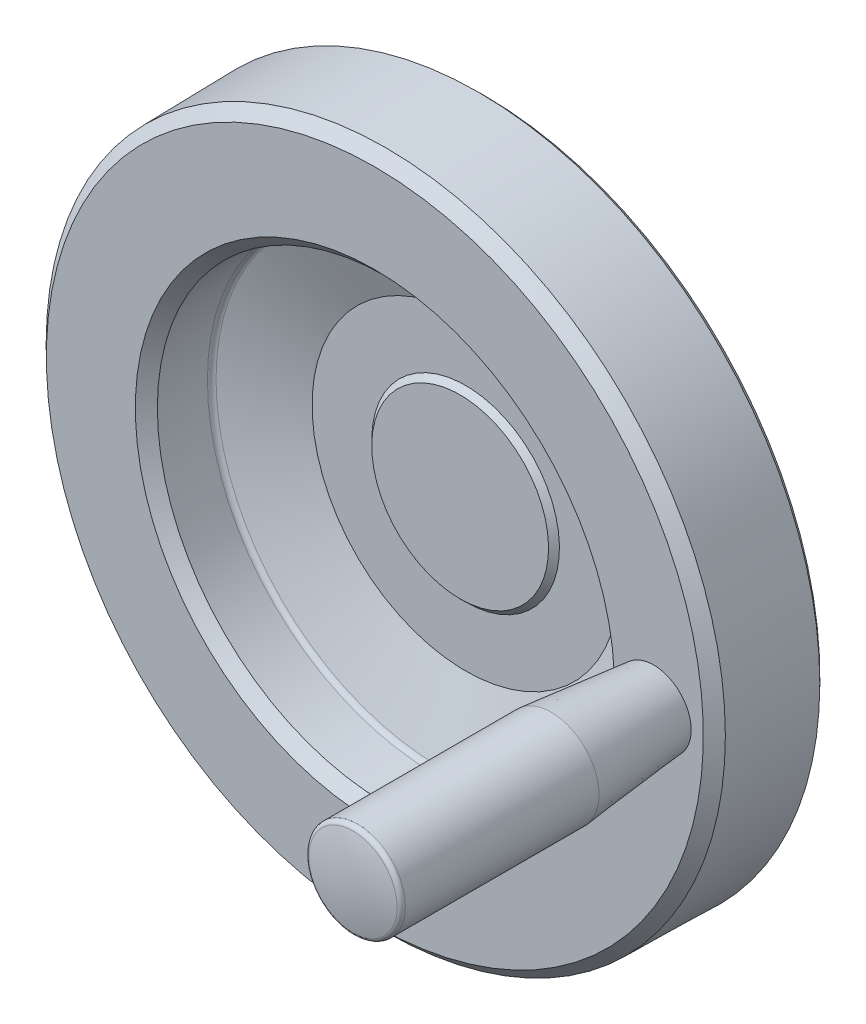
ISO-10303-21;
HEADER;
FILE_DESCRIPTION(('STEP AP214'),'2;1');
FILE_NAME('part.step','',(''),(''),'','','');
FILE_SCHEMA(('AUTOMOTIVE_DESIGN { 1 0 10303 214 1 1 1 1 }'));
ENDSEC;
DATA;
#1=APPLICATION_CONTEXT('core data for automotive mechanical design processes');
#2=APPLICATION_PROTOCOL_DEFINITION('international standard','automotive_design',2000,#1);
#3=PRODUCT_CONTEXT('',#1,'mechanical');
#4=PRODUCT('Part','Part','',(#3));
#5=PRODUCT_RELATED_PRODUCT_CATEGORY('part','',(#4));
#6=PRODUCT_DEFINITION_FORMATION('','',#4);
#7=PRODUCT_DEFINITION_CONTEXT('part definition',#1,'design');
#8=PRODUCT_DEFINITION('design','',#6,#7);
#9=PRODUCT_DEFINITION_SHAPE('','',#8);
#10=(LENGTH_UNIT() NAMED_UNIT(*) SI_UNIT(.MILLI.,.METRE.));
#11=(NAMED_UNIT(*) PLANE_ANGLE_UNIT() SI_UNIT($,.RADIAN.));
#12=(NAMED_UNIT(*) SI_UNIT($,.STERADIAN.) SOLID_ANGLE_UNIT());
#13=UNCERTAINTY_MEASURE_WITH_UNIT(LENGTH_MEASURE(1.E-05),#10,'distance_accuracy_value','');
#14=(GEOMETRIC_REPRESENTATION_CONTEXT(3) GLOBAL_UNCERTAINTY_ASSIGNED_CONTEXT((#13)) GLOBAL_UNIT_ASSIGNED_CONTEXT((#10,
#11,#12)) REPRESENTATION_CONTEXT('',''));
#15=CARTESIAN_POINT('',(0.,0.,0.));
#16=DIRECTION('',(0.,0.,1.));
#17=DIRECTION('',(1.,0.,0.));
#18=AXIS2_PLACEMENT_3D('',#15,#16,#17);
#19=CARTESIAN_POINT('',(82.,0.,51.919999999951));
#20=DIRECTION('',(0.,0.,1.));
#21=DIRECTION('',(-1.,0.,0.));
#22=AXIS2_PLACEMENT_3D('',#19,#20,#21);
#23=CONICAL_SURFACE('',#22,4.99999999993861,0.785398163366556);
#24=CARTESIAN_POINT('',(82.,0.,51.));
#25=DIRECTION('',(0.,0.,1.));
#26=DIRECTION('',(-1.,0.,0.));
#27=AXIS2_PLACEMENT_3D('',#24,#25,#26);
#28=CIRCLE('',#27,4.0800000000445);
#29=CARTESIAN_POINT('',(77.9199999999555,0.,51.));
#30=VERTEX_POINT('',#29);
#31=EDGE_CURVE('E132',#30,#30,#28,.T.);
#32=ORIENTED_EDGE('',*,*,#31,.T.);
#33=EDGE_LOOP('',(#32));
#34=FACE_BOUND('',#33,.T.);
#35=CARTESIAN_POINT('',(82.,0.,51.1079999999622));
#36=DIRECTION('',(0.,0.,1.));
#37=DIRECTION('',(0.,1.,0.));
#38=AXIS2_PLACEMENT_3D('',#35,#36,#37);
#39=CIRCLE('',#38,4.188);
#40=CARTESIAN_POINT('',(82.,4.188,51.1079999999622));
#41=VERTEX_POINT('',#40);
#42=EDGE_CURVE('E9',#41,#41,#39,.T.);
#43=ORIENTED_EDGE('',*,*,#42,.F.);
#44=EDGE_LOOP('',(#43));
#45=FACE_BOUND('',#44,.T.);
#46=ADVANCED_FACE('F15',(#34,#45),#23,.T.);
#47=CARTESIAN_POINT('',(82.,0.,51.));
#48=DIRECTION('',(0.,0.,1.));
#49=DIRECTION('',(-1.,0.,0.));
#50=AXIS2_PLACEMENT_3D('',#47,#48,#49);
#51=PLANE('',#50);
#52=DIRECTION('',(0.866025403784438,-0.5,0.));
#53=VECTOR('',#52,1.);
#54=CARTESIAN_POINT('',(82.,2.88675134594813,51.));
#55=LINE('',#54,#53);
#56=CARTESIAN_POINT('',(82.,2.88675134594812,51.));
#57=VERTEX_POINT('',#56);
#58=CARTESIAN_POINT('',(84.5,1.44337567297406,51.));
#59=VERTEX_POINT('',#58);
#60=EDGE_CURVE('E35',#57,#59,#55,.T.);
#61=ORIENTED_EDGE('',*,*,#60,.F.);
#62=DIRECTION('',(0.866025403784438,0.5,0.));
#63=VECTOR('',#62,1.);
#64=CARTESIAN_POINT('',(79.5,1.44337567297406,51.));
#65=LINE('',#64,#63);
#66=CARTESIAN_POINT('',(79.5,1.44337567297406,51.));
#67=VERTEX_POINT('',#66);
#68=EDGE_CURVE('E190',#67,#57,#65,.T.);
#69=ORIENTED_EDGE('',*,*,#68,.F.);
#70=DIRECTION('',(0.,-1.,0.));
#71=VECTOR('',#70,1.);
#72=CARTESIAN_POINT('',(79.5,0.,51.));
#73=LINE('',#72,#71);
#74=CARTESIAN_POINT('',(79.5,-1.44337567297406,51.));
#75=VERTEX_POINT('',#74);
#76=EDGE_CURVE('E188',#75,#67,#73,.F.);
#77=ORIENTED_EDGE('',*,*,#76,.F.);
#78=DIRECTION('',(-0.866025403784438,0.5,0.));
#79=VECTOR('',#78,1.);
#80=CARTESIAN_POINT('',(82.,-2.88675134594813,51.));
#81=LINE('',#80,#79);
#82=CARTESIAN_POINT('',(82.,-2.88675134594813,51.));
#83=VERTEX_POINT('',#82);
#84=EDGE_CURVE('E186',#83,#75,#81,.T.);
#85=ORIENTED_EDGE('',*,*,#84,.F.);
#86=DIRECTION('',(-0.866025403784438,-0.5,0.));
#87=VECTOR('',#86,1.);
#88=CARTESIAN_POINT('',(84.5,-1.44337567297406,51.));
#89=LINE('',#88,#87);
#90=CARTESIAN_POINT('',(84.5,-1.44337567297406,51.));
#91=VERTEX_POINT('',#90);
#92=EDGE_CURVE('E153',#91,#83,#89,.T.);
#93=ORIENTED_EDGE('',*,*,#92,.F.);
#94=DIRECTION('',(0.,-1.,0.));
#95=VECTOR('',#94,1.);
#96=CARTESIAN_POINT('',(84.5,0.,51.));
#97=LINE('',#96,#95);
#98=EDGE_CURVE('E136',#59,#91,#97,.T.);
#99=ORIENTED_EDGE('',*,*,#98,.F.);
#100=EDGE_LOOP('',(#61,#69,#77,#85,#93,#99));
#101=FACE_BOUND('',#100,.T.);
#102=ORIENTED_EDGE('',*,*,#31,.F.);
#103=EDGE_LOOP('',(#102));
#104=FACE_BOUND('',#103,.T.);
#105=ADVANCED_FACE('F229',(#101,#104),#51,.F.);
#106=CARTESIAN_POINT('',(84.5,1.44337567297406,55.25));
#107=DIRECTION('',(-0.5,-0.866025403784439,0.));
#108=DIRECTION('',(0.866025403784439,-0.5,0.));
#109=AXIS2_PLACEMENT_3D('',#106,#107,#108);
#110=PLANE('',#109);
#111=DIRECTION('',(-0.866025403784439,0.5,0.));
#112=VECTOR('',#111,1.);
#113=CARTESIAN_POINT('',(83.25,2.1650635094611,55.25));
#114=LINE('',#113,#112);
#115=CARTESIAN_POINT('',(83.2499999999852,2.1650635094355,55.2500000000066));
#116=VERTEX_POINT('',#115);
#117=CARTESIAN_POINT('',(82.,2.88675134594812,55.25));
#118=VERTEX_POINT('',#117);
#119=EDGE_CURVE('E97',#116,#118,#114,.T.);
#120=ORIENTED_EDGE('',*,*,#119,.T.);
#121=DIRECTION('',(0.,0.,1.));
#122=VECTOR('',#121,1.);
#123=CARTESIAN_POINT('',(82.,2.88675134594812,55.25));
#124=LINE('',#123,#122);
#125=EDGE_CURVE('E155',#118,#57,#124,.F.);
#126=ORIENTED_EDGE('',*,*,#125,.T.);
#127=ORIENTED_EDGE('',*,*,#60,.T.);
#128=DIRECTION('',(0.,0.,-1.));
#129=VECTOR('',#128,1.);
#130=CARTESIAN_POINT('',(84.5,1.44337567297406,55.25));
#131=LINE('',#130,#129);
#132=CARTESIAN_POINT('',(84.5,1.44337567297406,55.25));
#133=VERTEX_POINT('',#132);
#134=EDGE_CURVE('E99',#133,#59,#131,.T.);
#135=ORIENTED_EDGE('',*,*,#134,.F.);
#136=DIRECTION('',(-0.866025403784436,0.5,0.));
#137=VECTOR('',#136,1.);
#138=CARTESIAN_POINT('',(84.5,1.44337567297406,55.25));
#139=LINE('',#138,#137);
#140=EDGE_CURVE('E93',#133,#116,#139,.T.);
#141=ORIENTED_EDGE('',*,*,#140,.T.);
#142=EDGE_LOOP('',(#120,#126,#127,#135,#141));
#143=FACE_BOUND('',#142,.T.);
#144=ADVANCED_FACE('F95',(#143),#110,.T.);
#145=CARTESIAN_POINT('',(82.,2.88675134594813,55.25));
#146=DIRECTION('',(0.5,-0.866025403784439,0.));
#147=DIRECTION('',(0.866025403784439,0.5,0.));
#148=AXIS2_PLACEMENT_3D('',#145,#146,#147);
#149=PLANE('',#148);
#150=DIRECTION('',(-0.866025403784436,-0.5,0.));
#151=VECTOR('',#150,1.);
#152=CARTESIAN_POINT('',(80.75,2.1650635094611,55.25));
#153=LINE('',#152,#151);
#154=CARTESIAN_POINT('',(80.7500000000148,2.1650635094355,55.2500000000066));
#155=VERTEX_POINT('',#154);
#156=CARTESIAN_POINT('',(79.5,1.44337567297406,55.25));
#157=VERTEX_POINT('',#156);
#158=EDGE_CURVE('E167',#155,#157,#153,.T.);
#159=ORIENTED_EDGE('',*,*,#158,.T.);
#160=DIRECTION('',(0.,0.,1.));
#161=VECTOR('',#160,1.);
#162=CARTESIAN_POINT('',(79.5,1.44337567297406,55.25));
#163=LINE('',#162,#161);
#164=EDGE_CURVE('E157',#157,#67,#163,.F.);
#165=ORIENTED_EDGE('',*,*,#164,.T.);
#166=ORIENTED_EDGE('',*,*,#68,.T.);
#167=ORIENTED_EDGE('',*,*,#125,.F.);
#168=DIRECTION('',(-0.866025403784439,-0.5,0.));
#169=VECTOR('',#168,1.);
#170=CARTESIAN_POINT('',(82.,2.88675134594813,55.25));
#171=LINE('',#170,#169);
#172=EDGE_CURVE('E114',#118,#155,#171,.T.);
#173=ORIENTED_EDGE('',*,*,#172,.T.);
#174=EDGE_LOOP('',(#159,#165,#166,#167,#173));
#175=FACE_BOUND('',#174,.T.);
#176=ADVANCED_FACE('F240',(#175),#149,.T.);
#177=CARTESIAN_POINT('',(79.5,1.44337567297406,55.25));
#178=DIRECTION('',(1.,0.,0.));
#179=DIRECTION('',(0.,0.,1.));
#180=AXIS2_PLACEMENT_3D('',#177,#178,#179);
#181=PLANE('',#180);
#182=DIRECTION('',(0.,-1.,0.));
#183=VECTOR('',#182,1.);
#184=CARTESIAN_POINT('',(79.5,0.,55.25));
#185=LINE('',#184,#183);
#186=CARTESIAN_POINT('',(79.5000000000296,0.,55.2500000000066));
#187=VERTEX_POINT('',#186);
#188=CARTESIAN_POINT('',(79.5,-1.44337567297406,55.25));
#189=VERTEX_POINT('',#188);
#190=EDGE_CURVE('E171',#187,#189,#185,.T.);
#191=ORIENTED_EDGE('',*,*,#190,.T.);
#192=DIRECTION('',(0.,0.,1.));
#193=VECTOR('',#192,1.);
#194=CARTESIAN_POINT('',(79.5,-1.44337567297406,55.25));
#195=LINE('',#194,#193);
#196=EDGE_CURVE('E160',#189,#75,#195,.F.);
#197=ORIENTED_EDGE('',*,*,#196,.T.);
#198=ORIENTED_EDGE('',*,*,#76,.T.);
#199=ORIENTED_EDGE('',*,*,#164,.F.);
#200=DIRECTION('',(0.,-1.,0.));
#201=VECTOR('',#200,1.);
#202=CARTESIAN_POINT('',(79.5,0.,55.25));
#203=LINE('',#202,#201);
#204=EDGE_CURVE('E169',#157,#187,#203,.T.);
#205=ORIENTED_EDGE('',*,*,#204,.T.);
#206=EDGE_LOOP('',(#191,#197,#198,#199,#205));
#207=FACE_BOUND('',#206,.T.);
#208=ADVANCED_FACE('F243',(#207),#181,.T.);
#209=CARTESIAN_POINT('',(79.5,-1.44337567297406,55.25));
#210=DIRECTION('',(0.5,0.866025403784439,0.));
#211=DIRECTION('',(-0.866025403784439,0.5,0.));
#212=AXIS2_PLACEMENT_3D('',#209,#210,#211);
#213=PLANE('',#212);
#214=DIRECTION('',(-0.866025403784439,0.5,0.));
#215=VECTOR('',#214,1.);
#216=CARTESIAN_POINT('',(79.5,-1.44337567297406,55.25));
#217=LINE('',#216,#215);
#218=CARTESIAN_POINT('',(80.7500000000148,-2.1650635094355,55.2500000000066));
#219=VERTEX_POINT('',#218);
#220=CARTESIAN_POINT('',(82.,-2.88675134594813,55.25));
#221=VERTEX_POINT('',#220);
#222=EDGE_CURVE('E180',#219,#221,#217,.F.);
#223=ORIENTED_EDGE('',*,*,#222,.T.);
#224=DIRECTION('',(0.,0.,1.));
#225=VECTOR('',#224,1.);
#226=CARTESIAN_POINT('',(82.,-2.88675134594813,55.25));
#227=LINE('',#226,#225);
#228=EDGE_CURVE('E163',#221,#83,#227,.F.);
#229=ORIENTED_EDGE('',*,*,#228,.T.);
#230=ORIENTED_EDGE('',*,*,#84,.T.);
#231=ORIENTED_EDGE('',*,*,#196,.F.);
#232=DIRECTION('',(0.866025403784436,-0.5,0.));
#233=VECTOR('',#232,1.);
#234=CARTESIAN_POINT('',(79.5,-1.44337567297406,55.25));
#235=LINE('',#234,#233);
#236=EDGE_CURVE('E173',#189,#219,#235,.T.);
#237=ORIENTED_EDGE('',*,*,#236,.T.);
#238=EDGE_LOOP('',(#223,#229,#230,#231,#237));
#239=FACE_BOUND('',#238,.T.);
#240=ADVANCED_FACE('F247',(#239),#213,.T.);
#241=CARTESIAN_POINT('',(82.,-2.88675134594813,55.25));
#242=DIRECTION('',(-0.5,0.866025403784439,0.));
#243=DIRECTION('',(-0.866025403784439,-0.5,0.));
#244=AXIS2_PLACEMENT_3D('',#241,#242,#243);
#245=PLANE('',#244);
#246=DIRECTION('',(0.866025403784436,0.5,0.));
#247=VECTOR('',#246,1.);
#248=CARTESIAN_POINT('',(83.25,-2.1650635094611,55.25));
#249=LINE('',#248,#247);
#250=CARTESIAN_POINT('',(83.2499999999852,-2.1650635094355,55.2500000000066));
#251=VERTEX_POINT('',#250);
#252=CARTESIAN_POINT('',(84.5,-1.44337567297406,55.25));
#253=VERTEX_POINT('',#252);
#254=EDGE_CURVE('E175',#251,#253,#249,.T.);
#255=ORIENTED_EDGE('',*,*,#254,.T.);
#256=DIRECTION('',(0.,0.,-1.));
#257=VECTOR('',#256,1.);
#258=CARTESIAN_POINT('',(84.5,-1.44337567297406,55.25));
#259=LINE('',#258,#257);
#260=EDGE_CURVE('E154',#91,#253,#259,.F.);
#261=ORIENTED_EDGE('',*,*,#260,.F.);
#262=ORIENTED_EDGE('',*,*,#92,.T.);
#263=ORIENTED_EDGE('',*,*,#228,.F.);
#264=DIRECTION('',(-0.866025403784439,-0.5,0.));
#265=VECTOR('',#264,1.);
#266=CARTESIAN_POINT('',(82.,-2.88675134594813,55.25));
#267=LINE('',#266,#265);
#268=EDGE_CURVE('E131',#221,#251,#267,.F.);
#269=ORIENTED_EDGE('',*,*,#268,.T.);
#270=EDGE_LOOP('',(#255,#261,#262,#263,#269));
#271=FACE_BOUND('',#270,.T.);
#272=ADVANCED_FACE('F237',(#271),#245,.T.);
#273=CARTESIAN_POINT('',(84.5,-1.44337567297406,55.25));
#274=DIRECTION('',(-1.,0.,0.));
#275=DIRECTION('',(0.,0.,-1.));
#276=AXIS2_PLACEMENT_3D('',#273,#274,#275);
#277=PLANE('',#276);
#278=DIRECTION('',(0.,-1.,0.));
#279=VECTOR('',#278,1.);
#280=CARTESIAN_POINT('',(84.5,0.,55.25));
#281=LINE('',#280,#279);
#282=CARTESIAN_POINT('',(84.4999999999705,0.,55.2500000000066));
#283=VERTEX_POINT('',#282);
#284=EDGE_CURVE('E101',#283,#133,#281,.F.);
#285=ORIENTED_EDGE('',*,*,#284,.T.);
#286=ORIENTED_EDGE('',*,*,#134,.T.);
#287=ORIENTED_EDGE('',*,*,#98,.T.);
#288=ORIENTED_EDGE('',*,*,#260,.T.);
#289=DIRECTION('',(0.,-1.,0.));
#290=VECTOR('',#289,1.);
#291=CARTESIAN_POINT('',(84.5,0.,55.25));
#292=LINE('',#291,#290);
#293=EDGE_CURVE('E89',#253,#283,#292,.F.);
#294=ORIENTED_EDGE('',*,*,#293,.T.);
#295=EDGE_LOOP('',(#285,#286,#287,#288,#294));
#296=FACE_BOUND('',#295,.T.);
#297=ADVANCED_FACE('F234',(#296),#277,.T.);
#298=CARTESIAN_POINT('',(82.,0.,55.25));
#299=DIRECTION('',(0.,0.,1.));
#300=DIRECTION('',(-1.,0.,0.));
#301=AXIS2_PLACEMENT_3D('',#298,#299,#300);
#302=PLANE('',#301);
#303=ORIENTED_EDGE('',*,*,#172,.F.);
#304=ORIENTED_EDGE('',*,*,#119,.F.);
#305=CARTESIAN_POINT('',(82.,0.,55.2500000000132));
#306=DIRECTION('',(0.,0.,-1.));
#307=DIRECTION('',(1.,0.,0.));
#308=AXIS2_PLACEMENT_3D('',#305,#306,#307);
#309=CIRCLE('',#308,2.49999999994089);
#310=EDGE_CURVE('E108',#116,#155,#309,.F.);
#311=ORIENTED_EDGE('',*,*,#310,.T.);
#312=EDGE_LOOP('',(#303,#304,#311));
#313=FACE_BOUND('',#312,.T.);
#314=ADVANCED_FACE('F112',(#313),#302,.F.);
#315=CARTESIAN_POINT('',(82.,0.,55.25));
#316=DIRECTION('',(0.,0.,1.));
#317=DIRECTION('',(-1.,0.,0.));
#318=AXIS2_PLACEMENT_3D('',#315,#316,#317);
#319=PLANE('',#318);
#320=ORIENTED_EDGE('',*,*,#140,.F.);
#321=ORIENTED_EDGE('',*,*,#284,.F.);
#322=CARTESIAN_POINT('',(82.,0.,55.2500000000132));
#323=DIRECTION('',(0.,0.,-1.));
#324=DIRECTION('',(1.,0.,0.));
#325=AXIS2_PLACEMENT_3D('',#322,#323,#324);
#326=CIRCLE('',#325,2.49999999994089);
#327=EDGE_CURVE('E19',#283,#116,#326,.F.);
#328=ORIENTED_EDGE('',*,*,#327,.T.);
#329=EDGE_LOOP('',(#320,#321,#328));
#330=FACE_BOUND('',#329,.T.);
#331=ADVANCED_FACE('F17',(#330),#319,.F.);
#332=CARTESIAN_POINT('',(82.,0.,55.25));
#333=DIRECTION('',(0.,0.,1.));
#334=DIRECTION('',(-1.,0.,0.));
#335=AXIS2_PLACEMENT_3D('',#332,#333,#334);
#336=PLANE('',#335);
#337=ORIENTED_EDGE('',*,*,#204,.F.);
#338=ORIENTED_EDGE('',*,*,#158,.F.);
#339=CARTESIAN_POINT('',(82.,0.,55.2500000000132));
#340=DIRECTION('',(0.,0.,-1.));
#341=DIRECTION('',(1.,0.,0.));
#342=AXIS2_PLACEMENT_3D('',#339,#340,#341);
#343=CIRCLE('',#342,2.49999999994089);
#344=EDGE_CURVE('E121',#155,#187,#343,.F.);
#345=ORIENTED_EDGE('',*,*,#344,.T.);
#346=EDGE_LOOP('',(#337,#338,#345));
#347=FACE_BOUND('',#346,.T.);
#348=ADVANCED_FACE('F269',(#347),#336,.F.);
#349=CARTESIAN_POINT('',(82.,0.,55.25));
#350=DIRECTION('',(0.,0.,1.));
#351=DIRECTION('',(-1.,0.,0.));
#352=AXIS2_PLACEMENT_3D('',#349,#350,#351);
#353=PLANE('',#352);
#354=ORIENTED_EDGE('',*,*,#236,.F.);
#355=ORIENTED_EDGE('',*,*,#190,.F.);
#356=CARTESIAN_POINT('',(82.,0.,55.2500000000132));
#357=DIRECTION('',(0.,0.,-1.));
#358=DIRECTION('',(1.,0.,0.));
#359=AXIS2_PLACEMENT_3D('',#356,#357,#358);
#360=CIRCLE('',#359,2.49999999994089);
#361=EDGE_CURVE('E122',#187,#219,#360,.F.);
#362=ORIENTED_EDGE('',*,*,#361,.T.);
#363=EDGE_LOOP('',(#354,#355,#362));
#364=FACE_BOUND('',#363,.T.);
#365=ADVANCED_FACE('F259',(#364),#353,.F.);
#366=CARTESIAN_POINT('',(82.,0.,55.25));
#367=DIRECTION('',(0.,0.,1.));
#368=DIRECTION('',(-1.,0.,0.));
#369=AXIS2_PLACEMENT_3D('',#366,#367,#368);
#370=PLANE('',#369);
#371=ORIENTED_EDGE('',*,*,#268,.F.);
#372=ORIENTED_EDGE('',*,*,#222,.F.);
#373=CARTESIAN_POINT('',(82.,0.,55.2500000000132));
#374=DIRECTION('',(0.,0.,-1.));
#375=DIRECTION('',(1.,0.,0.));
#376=AXIS2_PLACEMENT_3D('',#373,#374,#375);
#377=CIRCLE('',#376,2.49999999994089);
#378=EDGE_CURVE('E129',#251,#219,#377,.T.);
#379=ORIENTED_EDGE('',*,*,#378,.F.);
#380=EDGE_LOOP('',(#371,#372,#379));
#381=FACE_BOUND('',#380,.T.);
#382=ADVANCED_FACE('F255',(#381),#370,.F.);
#383=CARTESIAN_POINT('',(82.,0.,55.25));
#384=DIRECTION('',(0.,0.,1.));
#385=DIRECTION('',(-1.,0.,0.));
#386=AXIS2_PLACEMENT_3D('',#383,#384,#385);
#387=PLANE('',#386);
#388=ORIENTED_EDGE('',*,*,#293,.F.);
#389=ORIENTED_EDGE('',*,*,#254,.F.);
#390=CARTESIAN_POINT('',(82.,0.,55.2500000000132));
#391=DIRECTION('',(0.,0.,-1.));
#392=DIRECTION('',(1.,0.,0.));
#393=AXIS2_PLACEMENT_3D('',#390,#391,#392);
#394=CIRCLE('',#393,2.49999999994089);
#395=EDGE_CURVE('E127',#251,#283,#394,.F.);
#396=ORIENTED_EDGE('',*,*,#395,.T.);
#397=EDGE_LOOP('',(#388,#389,#396));
#398=FACE_BOUND('',#397,.T.);
#399=ADVANCED_FACE('F258',(#398),#387,.F.);
#400=CARTESIAN_POINT('',(82.,0.,55.2500000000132));
#401=DIRECTION('',(0.,0.,-1.));
#402=DIRECTION('',(1.,0.,0.));
#403=AXIS2_PLACEMENT_3D('',#400,#401,#402);
#404=CONICAL_SURFACE('',#403,2.49999999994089,1.04719755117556);
#405=CARTESIAN_POINT('',(81.9999999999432,0.,56.6933756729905));
#406=VERTEX_POINT('',#405);
#407=VERTEX_LOOP('',#406);
#408=FACE_BOUND('',#407,.T.);
#409=ORIENTED_EDGE('',*,*,#378,.T.);
#410=ORIENTED_EDGE('',*,*,#361,.F.);
#411=ORIENTED_EDGE('',*,*,#344,.F.);
#412=ORIENTED_EDGE('',*,*,#310,.F.);
#413=ORIENTED_EDGE('',*,*,#327,.F.);
#414=ORIENTED_EDGE('',*,*,#395,.F.);
#415=EDGE_LOOP('',(#409,#410,#411,#412,#413,#414));
#416=FACE_BOUND('',#415,.T.);
#417=ADVANCED_FACE('F118',(#408,#416),#404,.F.);
#418=CARTESIAN_POINT('',(82.,0.,158.));
#419=DIRECTION('',(0.,0.,-1.));
#420=DIRECTION('',(1.,0.,0.));
#421=AXIS2_PLACEMENT_3D('',#418,#419,#420);
#422=CYLINDRICAL_SURFACE('',#421,6.5);
#423=CARTESIAN_POINT('',(82.,0.,68.));
#424=DIRECTION('',(0.,0.,-1.));
#425=DIRECTION('',(0.,-1.,0.));
#426=AXIS2_PLACEMENT_3D('',#423,#424,#425);
#427=CIRCLE('',#426,6.5);
#428=CARTESIAN_POINT('',(82.,-6.5,68.));
#429=VERTEX_POINT('',#428);
#430=EDGE_CURVE('E329',#429,#429,#427,.T.);
#431=ORIENTED_EDGE('',*,*,#430,.F.);
#432=EDGE_LOOP('',(#431));
#433=FACE_BOUND('',#432,.T.);
#434=CARTESIAN_POINT('',(82.,0.,68.3));
#435=DIRECTION('',(0.,0.,-1.));
#436=DIRECTION('',(1.,0.,0.));
#437=AXIS2_PLACEMENT_3D('',#434,#435,#436);
#438=CIRCLE('',#437,6.5);
#439=CARTESIAN_POINT('',(88.5,0.,68.3));
#440=VERTEX_POINT('',#439);
#441=EDGE_CURVE('E142',#440,#440,#438,.T.);
#442=ORIENTED_EDGE('',*,*,#441,.T.);
#443=EDGE_LOOP('',(#442));
#444=FACE_BOUND('',#443,.T.);
#445=ADVANCED_FACE('F207',(#433,#444),#422,.T.);
#446=CARTESIAN_POINT('',(82.,-6.5,68.3));
#447=DIRECTION('',(0.,0.,1.));
#448=DIRECTION('',(-1.,0.,0.));
#449=AXIS2_PLACEMENT_3D('',#446,#447,#448);
#450=PLANE('',#449);
#451=ORIENTED_EDGE('',*,*,#441,.F.);
#452=EDGE_LOOP('',(#451));
#453=FACE_BOUND('',#452,.T.);
#454=CARTESIAN_POINT('',(82.,0.,68.3));
#455=DIRECTION('',(0.,0.,1.));
#456=DIRECTION('',(0.,-1.,0.));
#457=AXIS2_PLACEMENT_3D('',#454,#455,#456);
#458=CIRCLE('',#457,11.);
#459=CARTESIAN_POINT('',(82.,-11.,68.3));
#460=VERTEX_POINT('',#459);
#461=EDGE_CURVE('E148',#460,#460,#458,.T.);
#462=ORIENTED_EDGE('',*,*,#461,.F.);
#463=EDGE_LOOP('',(#462));
#464=FACE_BOUND('',#463,.T.);
#465=ADVANCED_FACE('F208',(#453,#464),#450,.F.);
#466=CARTESIAN_POINT('',(82.,0.,98.3));
#467=DIRECTION('',(0.,0.,1.));
#468=DIRECTION('',(0.,-1.,0.));
#469=AXIS2_PLACEMENT_3D('',#466,#467,#468);
#470=CONICAL_SURFACE('',#469,14.,0.099668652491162);
#471=ORIENTED_EDGE('',*,*,#461,.T.);
#472=EDGE_LOOP('',(#471));
#473=FACE_BOUND('',#472,.T.);
#474=CARTESIAN_POINT('',(82.,0.,98.3));
#475=DIRECTION('',(0.,0.,-1.));
#476=DIRECTION('',(1.,0.,0.));
#477=AXIS2_PLACEMENT_3D('',#474,#475,#476);
#478=CIRCLE('',#477,14.);
#479=CARTESIAN_POINT('',(96.,0.,98.3));
#480=VERTEX_POINT('',#479);
#481=EDGE_CURVE('E315',#480,#480,#478,.F.);
#482=ORIENTED_EDGE('',*,*,#481,.F.);
#483=EDGE_LOOP('',(#482));
#484=FACE_BOUND('',#483,.T.);
#485=ADVANCED_FACE('F296',(#473,#484),#470,.T.);
#486=CARTESIAN_POINT('',(82.,0.,158.));
#487=DIRECTION('',(0.,0.,-1.));
#488=DIRECTION('',(1.,0.,0.));
#489=AXIS2_PLACEMENT_3D('',#486,#487,#488);
#490=CYLINDRICAL_SURFACE('',#489,14.);
#491=ORIENTED_EDGE('',*,*,#481,.T.);
#492=EDGE_LOOP('',(#491));
#493=FACE_BOUND('',#492,.T.);
#494=CARTESIAN_POINT('',(82.,0.,155.051394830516));
#495=DIRECTION('',(0.,0.,-1.));
#496=DIRECTION('',(1.,0.,0.));
#497=AXIS2_PLACEMENT_3D('',#494,#495,#496);
#498=CIRCLE('',#497,14.);
#499=CARTESIAN_POINT('',(96.,0.,155.051394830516));
#500=VERTEX_POINT('',#499);
#501=EDGE_CURVE('E151',#500,#500,#498,.T.);
#502=ORIENTED_EDGE('',*,*,#501,.T.);
#503=EDGE_LOOP('',(#502));
#504=FACE_BOUND('',#503,.T.);
#505=ADVANCED_FACE('F293',(#493,#504),#490,.T.);
#506=CARTESIAN_POINT('',(82.,0.,155.051394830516));
#507=DIRECTION('',(0.,0.,1.));
#508=DIRECTION('',(-1.,0.,0.));
#509=AXIS2_PLACEMENT_3D('',#506,#507,#508);
#510=TOROIDAL_SURFACE('',#509,12.6,1.4);
#511=CARTESIAN_POINT('',(82.,0.,156.409728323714));
#512=DIRECTION('',(0.,0.,1.));
#513=DIRECTION('',(-1.,0.,0.));
#514=AXIS2_PLACEMENT_3D('',#511,#512,#513);
#515=CIRCLE('',#514,12.9390134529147);
#516=CARTESIAN_POINT('',(69.0609865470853,0.,156.409728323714));
#517=VERTEX_POINT('',#516);
#518=EDGE_CURVE('E145',#517,#517,#515,.F.);
#519=ORIENTED_EDGE('',*,*,#518,.T.);
#520=EDGE_LOOP('',(#519));
#521=FACE_BOUND('',#520,.T.);
#522=ORIENTED_EDGE('',*,*,#501,.F.);
#523=EDGE_LOOP('',(#522));
#524=FACE_BOUND('',#523,.T.);
#525=ADVANCED_FACE('F205',(#521,#524),#510,.T.);
#526=CARTESIAN_POINT('',(82.,-3.31679359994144E-13,104.566666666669));
#527=DIRECTION('',(0.,1.,0.));
#528=DIRECTION('',(-1.,0.,0.));
#529=AXIS2_PLACEMENT_3D('',#526,#527,#528);
#530=SPHERICAL_SURFACE('',#529,53.4333333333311);
#531=ORIENTED_EDGE('',*,*,#518,.F.);
#532=EDGE_LOOP('',(#531));
#533=FACE_BOUND('',#532,.T.);
#534=ADVANCED_FACE('F200',(#533),#530,.T.);
#535=CARTESIAN_POINT('',(82.,0.,36.));
#536=DIRECTION('',(0.,0.,1.));
#537=DIRECTION('',(0.,1.,0.));
#538=AXIS2_PLACEMENT_3D('',#535,#536,#537);
#539=CYLINDRICAL_SURFACE('',#538,4.188);
#540=ORIENTED_EDGE('',*,*,#42,.T.);
#541=EDGE_LOOP('',(#540));
#542=FACE_BOUND('',#541,.T.);
#543=CARTESIAN_POINT('',(82.,0.,36.8119999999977));
#544=DIRECTION('',(0.,0.,-1.));
#545=DIRECTION('',(0.,-1.,0.));
#546=AXIS2_PLACEMENT_3D('',#543,#544,#545);
#547=CIRCLE('',#546,4.18799999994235);
#548=CARTESIAN_POINT('',(82.,-4.18799999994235,36.8119999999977));
#549=VERTEX_POINT('',#548);
#550=EDGE_CURVE('E803',#549,#549,#547,.T.);
#551=ORIENTED_EDGE('',*,*,#550,.T.);
#552=EDGE_LOOP('',(#551));
#553=FACE_BOUND('',#552,.T.);
#554=ADVANCED_FACE('F204',(#542,#553),#539,.F.);
#555=CARTESIAN_POINT('',(82.,0.,36.000000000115));
#556=DIRECTION('',(0.,0.,-1.));
#557=DIRECTION('',(0.,-1.,0.));
#558=AXIS2_PLACEMENT_3D('',#555,#556,#557);
#559=CONICAL_SURFACE('',#558,4.99999999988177,0.785398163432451);
#560=ORIENTED_EDGE('',*,*,#550,.F.);
#561=EDGE_LOOP('',(#560));
#562=FACE_BOUND('',#561,.T.);
#563=CARTESIAN_POINT('',(82.,0.,36.0000000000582));
#564=DIRECTION('',(0.,0.,-1.));
#565=DIRECTION('',(0.,-1.,0.));
#566=AXIS2_PLACEMENT_3D('',#563,#564,#565);
#567=CIRCLE('',#566,4.99999999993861);
#568=CARTESIAN_POINT('',(82.,-4.99999999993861,36.0000000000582));
#569=VERTEX_POINT('',#568);
#570=EDGE_CURVE('E353',#569,#569,#567,.T.);
#571=ORIENTED_EDGE('',*,*,#570,.T.);
#572=EDGE_LOOP('',(#571));
#573=FACE_BOUND('',#572,.T.);
#574=ADVANCED_FACE('F482',(#562,#573),#559,.F.);
#575=CARTESIAN_POINT('',(-98.4279281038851,0.,36.));
#576=DIRECTION('',(0.,0.,1.));
#577=DIRECTION('',(0.,1.,0.));
#578=AXIS2_PLACEMENT_3D('',#575,#576,#577);
#579=PLANE('',#578);
#580=CARTESIAN_POINT('',(0.,0.,36.));
#581=DIRECTION('',(0.,0.,1.));
#582=DIRECTION('',(0.,1.,0.));
#583=AXIS2_PLACEMENT_3D('',#580,#581,#582);
#584=CIRCLE('',#583,98.4279281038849);
#585=CARTESIAN_POINT('',(0.,98.4279281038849,36.));
#586=VERTEX_POINT('',#585);
#587=EDGE_CURVE('E363',#586,#586,#584,.T.);
#588=ORIENTED_EDGE('',*,*,#587,.F.);
#589=EDGE_LOOP('',(#588));
#590=FACE_BOUND('',#589,.T.);
#591=ORIENTED_EDGE('',*,*,#570,.F.);
#592=EDGE_LOOP('',(#591));
#593=FACE_BOUND('',#592,.T.);
#594=CARTESIAN_POINT('',(0.,0.,36.));
#595=DIRECTION('',(0.,0.,1.));
#596=DIRECTION('',(0.,1.,0.));
#597=AXIS2_PLACEMENT_3D('',#594,#595,#596);
#598=CIRCLE('',#597,66.6666666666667);
#599=CARTESIAN_POINT('',(0.,66.6666666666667,36.));
#600=VERTEX_POINT('',#599);
#601=EDGE_CURVE('E350',#600,#600,#598,.F.);
#602=ORIENTED_EDGE('',*,*,#601,.F.);
#603=EDGE_LOOP('',(#602));
#604=FACE_BOUND('',#603,.T.);
#605=ADVANCED_FACE('F485',(#590,#593,#604),#579,.F.);
#606=CARTESIAN_POINT('',(-70.1933203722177,0.,68.));
#607=DIRECTION('',(0.,0.,-1.));
#608=DIRECTION('',(0.,-1.,0.));
#609=AXIS2_PLACEMENT_3D('',#606,#607,#608);
#610=PLANE('',#609);
#611=ORIENTED_EDGE('',*,*,#430,.T.);
#612=EDGE_LOOP('',(#611));
#613=FACE_BOUND('',#612,.T.);
#614=CARTESIAN_POINT('',(0.,0.,68.));
#615=DIRECTION('',(0.,0.,1.));
#616=DIRECTION('',(0.,1.,0.));
#617=AXIS2_PLACEMENT_3D('',#614,#615,#616);
#618=CIRCLE('',#617,70.1933203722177);
#619=CARTESIAN_POINT('',(0.,70.1933203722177,68.));
#620=VERTEX_POINT('',#619);
#621=EDGE_CURVE('E360',#620,#620,#618,.T.);
#622=ORIENTED_EDGE('',*,*,#621,.F.);
#623=EDGE_LOOP('',(#622));
#624=FACE_BOUND('',#623,.T.);
#625=CARTESIAN_POINT('',(0.,0.,68.));
#626=DIRECTION('',(0.,0.,-1.));
#627=DIRECTION('',(0.,-1.,0.));
#628=AXIS2_PLACEMENT_3D('',#625,#626,#627);
#629=CIRCLE('',#628,96.2693660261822);
#630=CARTESIAN_POINT('',(0.,-96.2693660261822,68.));
#631=VERTEX_POINT('',#630);
#632=EDGE_CURVE('E366',#631,#631,#629,.T.);
#633=ORIENTED_EDGE('',*,*,#632,.F.);
#634=EDGE_LOOP('',(#633));
#635=FACE_BOUND('',#634,.T.);
#636=ADVANCED_FACE('F634',(#613,#624,#635),#610,.F.);
#637=CARTESIAN_POINT('',(0.,0.,68.));
#638=DIRECTION('',(0.,0.,1.));
#639=DIRECTION('',(0.,1.,0.));
#640=AXIS2_PLACEMENT_3D('',#637,#638,#639);
#641=CONICAL_SURFACE('',#640,70.1933203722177,0.79412480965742);
#642=CARTESIAN_POINT('',(0.,0.,64.8004873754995));
#643=DIRECTION('',(0.,0.,1.));
#644=DIRECTION('',(0.,1.,0.));
#645=AXIS2_PLACEMENT_3D('',#642,#643,#644);
#646=CIRCLE('',#645,66.9374726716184);
#647=CARTESIAN_POINT('',(0.,66.9374726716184,64.8004873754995));
#648=VERTEX_POINT('',#647);
#649=EDGE_CURVE('E354',#648,#648,#646,.T.);
#650=ORIENTED_EDGE('',*,*,#649,.F.);
#651=EDGE_LOOP('',(#650));
#652=FACE_BOUND('',#651,.T.);
#653=ORIENTED_EDGE('',*,*,#621,.T.);
#654=EDGE_LOOP('',(#653));
#655=FACE_BOUND('',#654,.T.);
#656=ADVANCED_FACE('F480',(#652,#655),#641,.F.);
#657=CARTESIAN_POINT('',(0.,0.,64.8004873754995));
#658=DIRECTION('',(0.,0.,-1.));
#659=DIRECTION('',(0.,-1.,0.));
#660=AXIS2_PLACEMENT_3D('',#657,#658,#659);
#661=CONICAL_SURFACE('',#660,99.5252137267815,0.794124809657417);
#662=ORIENTED_EDGE('',*,*,#632,.T.);
#663=EDGE_LOOP('',(#662));
#664=FACE_BOUND('',#663,.T.);
#665=CARTESIAN_POINT('',(0.,0.,64.8004873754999));
#666=DIRECTION('',(0.,0.,-1.));
#667=DIRECTION('',(0.,-1.,0.));
#668=AXIS2_PLACEMENT_3D('',#665,#666,#667);
#669=CIRCLE('',#668,99.5252137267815);
#670=CARTESIAN_POINT('',(0.,-99.5252137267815,64.8004873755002));
#671=VERTEX_POINT('',#670);
#672=EDGE_CURVE('E331',#671,#671,#669,.T.);
#673=ORIENTED_EDGE('',*,*,#672,.F.);
#674=EDGE_LOOP('',(#673));
#675=FACE_BOUND('',#674,.T.);
#676=ADVANCED_FACE('F495',(#664,#675),#661,.T.);
#677=CARTESIAN_POINT('',(0.,0.,64.8004873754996));
#678=DIRECTION('',(0.,0.,1.));
#679=DIRECTION('',(0.,1.,0.));
#680=AXIS2_PLACEMENT_3D('',#677,#678,#679);
#681=CONICAL_SURFACE('',#680,66.9374726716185,0.0174532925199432);
#682=CARTESIAN_POINT('',(0.,0.,50.3855037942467));
#683=DIRECTION('',(0.,0.,1.));
#684=DIRECTION('',(0.,1.,0.));
#685=AXIS2_PLACEMENT_3D('',#682,#683,#684);
#686=CIRCLE('',#685,66.6858581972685);
#687=CARTESIAN_POINT('',(0.,66.6858581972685,50.3855037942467));
#688=VERTEX_POINT('',#687);
#689=EDGE_CURVE('E514',#688,#688,#686,.T.);
#690=ORIENTED_EDGE('',*,*,#689,.F.);
#691=EDGE_LOOP('',(#690));
#692=FACE_BOUND('',#691,.T.);
#693=ORIENTED_EDGE('',*,*,#649,.T.);
#694=EDGE_LOOP('',(#693));
#695=FACE_BOUND('',#694,.T.);
#696=ADVANCED_FACE('F492',(#692,#695),#681,.F.);
#697=CARTESIAN_POINT('',(0.,0.,37.5997563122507));
#698=DIRECTION('',(0.,0.,-1.));
#699=DIRECTION('',(0.,-1.,0.));
#700=AXIS2_PLACEMENT_3D('',#697,#698,#699);
#701=CONICAL_SURFACE('',#700,100.000004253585,0.0174532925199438);
#702=ORIENTED_EDGE('',*,*,#672,.T.);
#703=EDGE_LOOP('',(#702));
#704=FACE_BOUND('',#703,.T.);
#705=CARTESIAN_POINT('',(0.,0.,37.5997563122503));
#706=DIRECTION('',(0.,0.,-1.));
#707=DIRECTION('',(0.,-1.,0.));
#708=AXIS2_PLACEMENT_3D('',#705,#706,#707);
#709=CIRCLE('',#708,100.000004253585);
#710=CARTESIAN_POINT('',(0.,-100.000004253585,37.5997563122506));
#711=VERTEX_POINT('',#710);
#712=EDGE_CURVE('E369',#711,#711,#709,.F.);
#713=ORIENTED_EDGE('',*,*,#712,.T.);
#714=EDGE_LOOP('',(#713));
#715=FACE_BOUND('',#714,.T.);
#716=ADVANCED_FACE('F494',(#704,#715),#701,.T.);
#717=CARTESIAN_POINT('',(0.,0.,50.4134276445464));
#718=DIRECTION('',(0.,0.,-1.));
#719=DIRECTION('',(0.,-1.,0.));
#720=AXIS2_PLACEMENT_3D('',#717,#718,#719);
#721=TOROIDAL_SURFACE('',#720,65.0861018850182,1.6);
#722=CARTESIAN_POINT('',(0.,0.,48.9099194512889));
#723=DIRECTION('',(0.,0.,-1.));
#724=DIRECTION('',(0.,-1.,0.));
#725=AXIS2_PLACEMENT_3D('',#722,#723,#724);
#726=CIRCLE('',#725,65.6333341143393);
#727=CARTESIAN_POINT('',(0.,-65.6333341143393,48.9099194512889));
#728=VERTEX_POINT('',#727);
#729=EDGE_CURVE('E515',#728,#728,#726,.F.);
#730=ORIENTED_EDGE('',*,*,#729,.F.);
#731=EDGE_LOOP('',(#730));
#732=FACE_BOUND('',#731,.T.);
#733=ORIENTED_EDGE('',*,*,#689,.T.);
#734=EDGE_LOOP('',(#733));
#735=FACE_BOUND('',#734,.T.);
#736=ADVANCED_FACE('F504',(#732,#735),#721,.F.);
#737=CARTESIAN_POINT('',(0.,0.,37.5997563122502));
#738=DIRECTION('',(0.,0.,1.));
#739=DIRECTION('',(0.,1.,0.));
#740=AXIS2_PLACEMENT_3D('',#737,#738,#739);
#741=CONICAL_SURFACE('',#740,100.000004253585,0.776671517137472);
#742=ORIENTED_EDGE('',*,*,#712,.F.);
#743=EDGE_LOOP('',(#742));
#744=FACE_BOUND('',#743,.T.);
#745=ORIENTED_EDGE('',*,*,#587,.T.);
#746=EDGE_LOOP('',(#745));
#747=FACE_BOUND('',#746,.T.);
#748=ADVANCED_FACE('F490',(#744,#747),#741,.T.);
#749=CARTESIAN_POINT('',(0.,0.,0.));
#750=DIRECTION('',(0.,0.,1.));
#751=DIRECTION('',(0.,1.,0.));
#752=AXIS2_PLACEMENT_3D('',#749,#750,#751);
#753=CYLINDRICAL_SURFACE('',#752,66.6666666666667);
#754=ORIENTED_EDGE('',*,*,#601,.T.);
#755=EDGE_LOOP('',(#754));
#756=FACE_BOUND('',#755,.T.);
#757=CARTESIAN_POINT('',(0.,0.,39.7149631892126));
#758=DIRECTION('',(0.,0.,1.));
#759=DIRECTION('',(0.,1.,0.));
#760=AXIS2_PLACEMENT_3D('',#757,#758,#759);
#761=CIRCLE('',#760,66.6666666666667);
#762=CARTESIAN_POINT('',(0.,66.6666666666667,39.7149631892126));
#763=VERTEX_POINT('',#762);
#764=EDGE_CURVE('E802',#763,#763,#761,.F.);
#765=ORIENTED_EDGE('',*,*,#764,.F.);
#766=EDGE_LOOP('',(#765));
#767=FACE_BOUND('',#766,.T.);
#768=ADVANCED_FACE('F487',(#756,#767),#753,.F.);
#769=CARTESIAN_POINT('',(0.,0.,48.9099194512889));
#770=DIRECTION('',(0.,0.,1.));
#771=DIRECTION('',(1.,0.,0.));
#772=AXIS2_PLACEMENT_3D('',#769,#770,#771);
#773=CONICAL_SURFACE('',#772,65.6333341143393,1.22173047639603);
#774=CARTESIAN_POINT('',(0.,0.,41.4));
#775=DIRECTION('',(0.,0.,1.));
#776=DIRECTION('',(1.,0.,0.));
#777=AXIS2_PLACEMENT_3D('',#774,#775,#776);
#778=CIRCLE('',#777,45.);
#779=CARTESIAN_POINT('',(45.,0.,41.4));
#780=VERTEX_POINT('',#779);
#781=EDGE_CURVE('E346',#780,#780,#778,.T.);
#782=ORIENTED_EDGE('',*,*,#781,.F.);
#783=EDGE_LOOP('',(#782));
#784=FACE_BOUND('',#783,.T.);
#785=ORIENTED_EDGE('',*,*,#729,.T.);
#786=EDGE_LOOP('',(#785));
#787=FACE_BOUND('',#786,.T.);
#788=ADVANCED_FACE('F390',(#784,#787),#773,.F.);
#789=CARTESIAN_POINT('',(0.,0.,39.7149631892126));
#790=DIRECTION('',(0.,0.,-1.));
#791=DIRECTION('',(0.,-1.,0.));
#792=AXIS2_PLACEMENT_3D('',#789,#790,#791);
#793=TOROIDAL_SURFACE('',#792,65.0666666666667,1.6);
#794=ORIENTED_EDGE('',*,*,#764,.T.);
#795=EDGE_LOOP('',(#794));
#796=FACE_BOUND('',#795,.T.);
#797=CARTESIAN_POINT('',(0.,0.,41.21847138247));
#798=DIRECTION('',(0.,0.,-1.));
#799=DIRECTION('',(0.,-1.,0.));
#800=AXIS2_PLACEMENT_3D('',#797,#798,#799);
#801=CIRCLE('',#800,64.5194344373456);
#802=CARTESIAN_POINT('',(0.,-64.5194344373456,41.21847138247));
#803=VERTEX_POINT('',#802);
#804=EDGE_CURVE('E511',#803,#803,#801,.T.);
#805=ORIENTED_EDGE('',*,*,#804,.F.);
#806=EDGE_LOOP('',(#805));
#807=FACE_BOUND('',#806,.T.);
#808=ADVANCED_FACE('F396',(#796,#807),#793,.F.);
#809=CARTESIAN_POINT('',(-27.5,0.,41.4));
#810=DIRECTION('',(0.,0.,-1.));
#811=DIRECTION('',(0.,-1.,0.));
#812=AXIS2_PLACEMENT_3D('',#809,#810,#811);
#813=PLANE('',#812);
#814=CARTESIAN_POINT('',(0.,0.,41.4));
#815=DIRECTION('',(0.,0.,-1.));
#816=DIRECTION('',(0.,-1.,0.));
#817=AXIS2_PLACEMENT_3D('',#814,#815,#816);
#818=CIRCLE('',#817,27.5);
#819=CARTESIAN_POINT('',(0.,-27.5,41.4));
#820=VERTEX_POINT('',#819);
#821=EDGE_CURVE('E342',#820,#820,#818,.F.);
#822=ORIENTED_EDGE('',*,*,#821,.F.);
#823=EDGE_LOOP('',(#822));
#824=FACE_BOUND('',#823,.T.);
#825=ORIENTED_EDGE('',*,*,#781,.T.);
#826=EDGE_LOOP('',(#825));
#827=FACE_BOUND('',#826,.T.);
#828=ADVANCED_FACE('F392',(#824,#827),#813,.F.);
#829=CARTESIAN_POINT('',(0.,0.,41.2184713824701));
#830=DIRECTION('',(0.,0.,1.));
#831=DIRECTION('',(0.,1.,0.));
#832=AXIS2_PLACEMENT_3D('',#829,#830,#831);
#833=CONICAL_SURFACE('',#832,64.5194344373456,1.22173047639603);
#834=ORIENTED_EDGE('',*,*,#804,.T.);
#835=EDGE_LOOP('',(#834));
#836=FACE_BOUND('',#835,.T.);
#837=CARTESIAN_POINT('',(0.,0.,29.0376008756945));
#838=DIRECTION('',(0.,0.,1.));
#839=DIRECTION('',(0.,1.,0.));
#840=AXIS2_PLACEMENT_3D('',#837,#838,#839);
#841=CIRCLE('',#840,31.0527677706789);
#842=CARTESIAN_POINT('',(0.,31.0527677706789,29.0376008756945));
#843=VERTEX_POINT('',#842);
#844=EDGE_CURVE('E349',#843,#843,#841,.T.);
#845=ORIENTED_EDGE('',*,*,#844,.T.);
#846=EDGE_LOOP('',(#845));
#847=FACE_BOUND('',#846,.T.);
#848=ADVANCED_FACE('F395',(#836,#847),#833,.T.);
#849=CARTESIAN_POINT('',(0.,0.,41.4));
#850=DIRECTION('',(0.,0.,-1.));
#851=DIRECTION('',(0.,-1.,0.));
#852=AXIS2_PLACEMENT_3D('',#849,#850,#851);
#853=CONICAL_SURFACE('',#852,27.5,0.785398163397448);
#854=CARTESIAN_POINT('',(0.,0.,43.));
#855=DIRECTION('',(0.,0.,-1.));
#856=DIRECTION('',(0.,-1.,0.));
#857=AXIS2_PLACEMENT_3D('',#854,#855,#856);
#858=CIRCLE('',#857,25.9);
#859=CARTESIAN_POINT('',(0.,-25.9,43.));
#860=VERTEX_POINT('',#859);
#861=EDGE_CURVE('E336',#860,#860,#858,.T.);
#862=ORIENTED_EDGE('',*,*,#861,.T.);
#863=EDGE_LOOP('',(#862));
#864=FACE_BOUND('',#863,.T.);
#865=ORIENTED_EDGE('',*,*,#821,.T.);
#866=EDGE_LOOP('',(#865));
#867=FACE_BOUND('',#866,.T.);
#868=ADVANCED_FACE('F388',(#864,#867),#853,.T.);
#869=CARTESIAN_POINT('',(0.,0.,27.534092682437));
#870=DIRECTION('',(0.,0.,-1.));
#871=DIRECTION('',(0.,-1.,0.));
#872=AXIS2_PLACEMENT_3D('',#869,#870,#871);
#873=TOROIDAL_SURFACE('',#872,31.6,1.6);
#874=ORIENTED_EDGE('',*,*,#844,.F.);
#875=EDGE_LOOP('',(#874));
#876=FACE_BOUND('',#875,.T.);
#877=CARTESIAN_POINT('',(0.,0.,27.534092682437));
#878=DIRECTION('',(0.,0.,-1.));
#879=DIRECTION('',(0.,-1.,0.));
#880=AXIS2_PLACEMENT_3D('',#877,#878,#879);
#881=CIRCLE('',#880,30.);
#882=CARTESIAN_POINT('',(0.,-30.,27.534092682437));
#883=VERTEX_POINT('',#882);
#884=EDGE_CURVE('E345',#883,#883,#881,.T.);
#885=ORIENTED_EDGE('',*,*,#884,.F.);
#886=EDGE_LOOP('',(#885));
#887=FACE_BOUND('',#886,.T.);
#888=ADVANCED_FACE('F383',(#876,#887),#873,.F.);
#889=CARTESIAN_POINT('',(0.,0.,43.));
#890=DIRECTION('',(0.,0.,-1.));
#891=DIRECTION('',(0.,-1.,0.));
#892=AXIS2_PLACEMENT_3D('',#889,#890,#891);
#893=PLANE('',#892);
#894=ORIENTED_EDGE('',*,*,#861,.F.);
#895=EDGE_LOOP('',(#894));
#896=FACE_BOUND('',#895,.T.);
#897=ADVANCED_FACE('F387',(#896),#893,.F.);
#898=CARTESIAN_POINT('',(0.,0.,0.));
#899=DIRECTION('',(0.,0.,1.));
#900=DIRECTION('',(0.,1.,0.));
#901=AXIS2_PLACEMENT_3D('',#898,#899,#900);
#902=CYLINDRICAL_SURFACE('',#901,30.);
#903=ORIENTED_EDGE('',*,*,#884,.T.);
#904=EDGE_LOOP('',(#903));
#905=FACE_BOUND('',#904,.T.);
#906=CARTESIAN_POINT('',(0.,0.,15.));
#907=DIRECTION('',(0.,0.,1.));
#908=DIRECTION('',(0.,1.,0.));
#909=AXIS2_PLACEMENT_3D('',#906,#907,#908);
#910=CIRCLE('',#909,30.);
#911=CARTESIAN_POINT('',(0.,30.,15.));
#912=VERTEX_POINT('',#911);
#913=EDGE_CURVE('E339',#912,#912,#910,.T.);
#914=ORIENTED_EDGE('',*,*,#913,.T.);
#915=EDGE_LOOP('',(#914));
#916=FACE_BOUND('',#915,.T.);
#917=ADVANCED_FACE('F398',(#905,#916),#902,.T.);
#918=CARTESIAN_POINT('',(-30.,0.,15.));
#919=DIRECTION('',(0.,0.,1.));
#920=DIRECTION('',(0.,1.,0.));
#921=AXIS2_PLACEMENT_3D('',#918,#919,#920);
#922=PLANE('',#921);
#923=ORIENTED_EDGE('',*,*,#913,.F.);
#924=EDGE_LOOP('',(#923));
#925=FACE_BOUND('',#924,.T.);
#926=CARTESIAN_POINT('',(0.,0.,15.));
#927=DIRECTION('',(0.,0.,1.));
#928=DIRECTION('',(0.,1.,0.));
#929=AXIS2_PLACEMENT_3D('',#926,#927,#928);
#930=CIRCLE('',#929,20.);
#931=CARTESIAN_POINT('',(0.,20.,15.));
#932=VERTEX_POINT('',#931);
#933=EDGE_CURVE('E333',#932,#932,#930,.F.);
#934=ORIENTED_EDGE('',*,*,#933,.F.);
#935=EDGE_LOOP('',(#934));
#936=FACE_BOUND('',#935,.T.);
#937=ADVANCED_FACE('F401',(#925,#936),#922,.F.);
#938=CARTESIAN_POINT('',(0.,0.,0.));
#939=DIRECTION('',(0.,0.,1.));
#940=DIRECTION('',(0.,1.,0.));
#941=AXIS2_PLACEMENT_3D('',#938,#939,#940);
#942=CYLINDRICAL_SURFACE('',#941,20.);
#943=ORIENTED_EDGE('',*,*,#933,.T.);
#944=EDGE_LOOP('',(#943));
#945=FACE_BOUND('',#944,.T.);
#946=CARTESIAN_POINT('',(0.,0.,0.75));
#947=DIRECTION('',(0.,0.,1.));
#948=DIRECTION('',(0.,1.,0.));
#949=AXIS2_PLACEMENT_3D('',#946,#947,#948);
#950=CIRCLE('',#949,20.);
#951=CARTESIAN_POINT('',(0.,20.,0.75));
#952=VERTEX_POINT('',#951);
#953=EDGE_CURVE('E319',#952,#952,#950,.T.);
#954=ORIENTED_EDGE('',*,*,#953,.T.);
#955=EDGE_LOOP('',(#954));
#956=FACE_BOUND('',#955,.T.);
#957=ADVANCED_FACE('F287',(#945,#956),#942,.T.);
#958=CARTESIAN_POINT('',(0.,0.,0.75));
#959=DIRECTION('',(0.,0.,1.));
#960=DIRECTION('',(0.,1.,0.));
#961=AXIS2_PLACEMENT_3D('',#958,#959,#960);
#962=CONICAL_SURFACE('',#961,20.,0.785398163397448);
#963=ORIENTED_EDGE('',*,*,#953,.F.);
#964=EDGE_LOOP('',(#963));
#965=FACE_BOUND('',#964,.T.);
#966=CARTESIAN_POINT('',(0.,0.,0.));
#967=DIRECTION('',(0.,0.,1.));
#968=DIRECTION('',(0.,1.,0.));
#969=AXIS2_PLACEMENT_3D('',#966,#967,#968);
#970=CIRCLE('',#969,19.25);
#971=CARTESIAN_POINT('',(0.,19.25,0.));
#972=VERTEX_POINT('',#971);
#973=EDGE_CURVE('E316',#972,#972,#970,.T.);
#974=ORIENTED_EDGE('',*,*,#973,.T.);
#975=EDGE_LOOP('',(#974));
#976=FACE_BOUND('',#975,.T.);
#977=ADVANCED_FACE('F280',(#965,#976),#962,.T.);
#978=CARTESIAN_POINT('',(-19.25,0.,0.));
#979=DIRECTION('',(0.,0.,1.));
#980=DIRECTION('',(0.,1.,0.));
#981=AXIS2_PLACEMENT_3D('',#978,#979,#980);
#982=PLANE('',#981);
#983=ORIENTED_EDGE('',*,*,#973,.F.);
#984=EDGE_LOOP('',(#983));
#985=FACE_BOUND('',#984,.T.);
#986=ADVANCED_FACE('F278',(#985),#982,.F.);
#987=CLOSED_SHELL('',(#46,#105,#144,#176,#208,#240,#272,#297,#314,#331,#348,#365,#382,#399,#417,
#445,#465,#485,#505,#525,#534,#554,#574,#605,#636,#656,#676,#696,#716,#736,#748,#768,#788,#808,
#828,#848,#868,#888,#897,#917,#937,#957,#977,#986));
#988=CARTESIAN_POINT('',(82.,0.,67.1879999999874));
#989=DIRECTION('',(0.,0.,1.));
#990=DIRECTION('',(0.,1.,0.));
#991=AXIS2_PLACEMENT_3D('',#988,#989,#990);
#992=CIRCLE('',#991,4.1879999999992);
#993=CARTESIAN_POINT('',(82.,4.1879999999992,67.1879999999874));
#994=VERTEX_POINT('',#993);
#995=EDGE_CURVE('E806',#994,#994,#992,.T.);
#996=ORIENTED_EDGE('',*,*,#995,.T.);
#997=EDGE_LOOP('',(#996));
#998=FACE_BOUND('',#997,.T.);
#999=CARTESIAN_POINT('',(82.,0.,64.6));
#1000=DIRECTION('',(0.,0.,-1.));
#1001=DIRECTION('',(0.,-1.,0.));
#1002=AXIS2_PLACEMENT_3D('',#999,#1000,#1001);
#1003=CIRCLE('',#1002,4.188);
#1004=CARTESIAN_POINT('',(82.,-4.188,64.6));
#1005=VERTEX_POINT('',#1004);
#1006=EDGE_CURVE('E26',#1005,#1005,#1003,.F.);
#1007=ORIENTED_EDGE('',*,*,#1006,.F.);
#1008=EDGE_LOOP('',(#1007));
#1009=FACE_BOUND('',#1008,.T.);
#1010=ADVANCED_FACE('F441',(#998,#1009),#539,.F.);
#1011=CARTESIAN_POINT('',(82.,0.,67.9999999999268));
#1012=DIRECTION('',(0.,0.,1.));
#1013=DIRECTION('',(0.,1.,0.));
#1014=AXIS2_PLACEMENT_3D('',#1011,#1012,#1013);
#1015=CONICAL_SURFACE('',#1014,4.99999999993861,0.785398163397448);
#1016=CARTESIAN_POINT('',(82.,0.,67.9999999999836));
#1017=DIRECTION('',(0.,0.,1.));
#1018=DIRECTION('',(0.,1.,0.));
#1019=AXIS2_PLACEMENT_3D('',#1016,#1017,#1018);
#1020=CIRCLE('',#1019,4.99999999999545);
#1021=CARTESIAN_POINT('',(82.,4.99999999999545,67.9999999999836));
#1022=VERTEX_POINT('',#1021);
#1023=EDGE_CURVE('E357',#1022,#1022,#1020,.T.);
#1024=ORIENTED_EDGE('',*,*,#1023,.T.);
#1025=EDGE_LOOP('',(#1024));
#1026=FACE_BOUND('',#1025,.T.);
#1027=ORIENTED_EDGE('',*,*,#995,.F.);
#1028=EDGE_LOOP('',(#1027));
#1029=FACE_BOUND('',#1028,.T.);
#1030=ADVANCED_FACE('F222',(#1026,#1029),#1015,.F.);
#1031=CARTESIAN_POINT('',(82.,0.,96.));
#1032=DIRECTION('',(0.,0.,-1.));
#1033=DIRECTION('',(1.,0.,0.));
#1034=AXIS2_PLACEMENT_3D('',#1031,#1032,#1033);
#1035=CYLINDRICAL_SURFACE('',#1034,3.672);
#1036=CARTESIAN_POINT('',(82.,0.,64.6));
#1037=DIRECTION('',(0.,0.,-1.));
#1038=DIRECTION('',(1.,0.,0.));
#1039=AXIS2_PLACEMENT_3D('',#1036,#1037,#1038);
#1040=CIRCLE('',#1039,3.672);
#1041=CARTESIAN_POINT('',(85.672,0.,64.6));
#1042=VERTEX_POINT('',#1041);
#1043=EDGE_CURVE('E135',#1042,#1042,#1040,.F.);
#1044=ORIENTED_EDGE('',*,*,#1043,.T.);
#1045=EDGE_LOOP('',(#1044));
#1046=FACE_BOUND('',#1045,.T.);
#1047=CARTESIAN_POINT('',(82.,0.,68.));
#1048=DIRECTION('',(0.,0.,-1.));
#1049=DIRECTION('',(1.,0.,0.));
#1050=AXIS2_PLACEMENT_3D('',#1047,#1048,#1049);
#1051=CIRCLE('',#1050,3.672);
#1052=CARTESIAN_POINT('',(85.672,0.,68.));
#1053=VERTEX_POINT('',#1052);
#1054=EDGE_CURVE('E139',#1053,#1053,#1051,.T.);
#1055=ORIENTED_EDGE('',*,*,#1054,.T.);
#1056=EDGE_LOOP('',(#1055));
#1057=FACE_BOUND('',#1056,.T.);
#1058=ADVANCED_FACE('F217',(#1046,#1057),#1035,.T.);
#1059=CARTESIAN_POINT('',(82.,0.,68.));
#1060=DIRECTION('',(0.,0.,1.));
#1061=DIRECTION('',(-1.,0.,0.));
#1062=AXIS2_PLACEMENT_3D('',#1059,#1060,#1061);
#1063=PLANE('',#1062);
#1064=ORIENTED_EDGE('',*,*,#1054,.F.);
#1065=EDGE_LOOP('',(#1064));
#1066=FACE_BOUND('',#1065,.T.);
#1067=ORIENTED_EDGE('',*,*,#1023,.F.);
#1068=EDGE_LOOP('',(#1067));
#1069=FACE_BOUND('',#1068,.T.);
#1070=ADVANCED_FACE('F213',(#1066,#1069),#1063,.F.);
#1071=CARTESIAN_POINT('',(82.,-5.,64.6));
#1072=DIRECTION('',(0.,0.,-1.));
#1073=DIRECTION('',(1.,0.,0.));
#1074=AXIS2_PLACEMENT_3D('',#1071,#1072,#1073);
#1075=PLANE('',#1074);
#1076=ORIENTED_EDGE('',*,*,#1043,.F.);
#1077=EDGE_LOOP('',(#1076));
#1078=FACE_BOUND('',#1077,.T.);
#1079=ORIENTED_EDGE('',*,*,#1006,.T.);
#1080=EDGE_LOOP('',(#1079));
#1081=FACE_BOUND('',#1080,.T.);
#1082=ADVANCED_FACE('F216',(#1078,#1081),#1075,.F.);
#1083=CLOSED_SHELL('',(#1010,#1030,#1058,#1070,#1082));
#1084=ORIENTED_CLOSED_SHELL('',*,#1083,.T.);
#1085=BREP_WITH_VOIDS('B1',#987,(#1084));
#1086=ADVANCED_BREP_SHAPE_REPRESENTATION('',(#18,#1085),#14);
#1087=SHAPE_DEFINITION_REPRESENTATION(#9,#1086);
ENDSEC;
END-ISO-10303-21;
